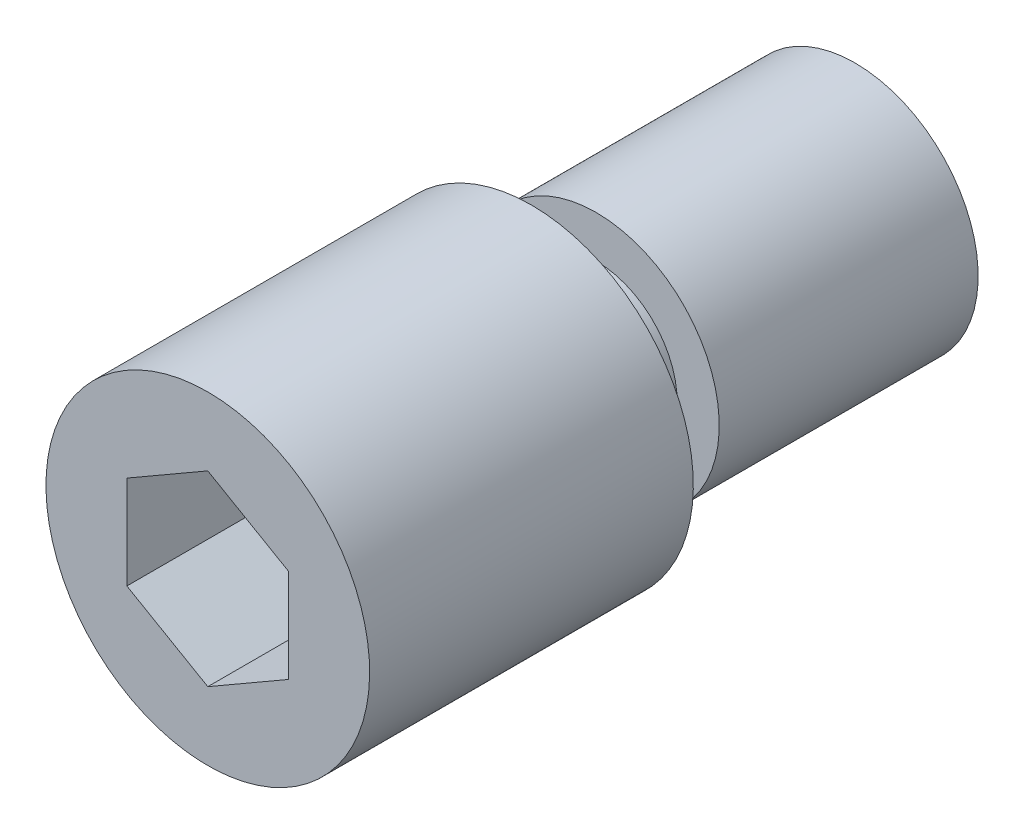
ISO-10303-21;
HEADER;
FILE_DESCRIPTION(('STEP AP214'),'2;1');
FILE_NAME('part.step','',(''),(''),'','','');
FILE_SCHEMA(('AUTOMOTIVE_DESIGN { 1 0 10303 214 1 1 1 1 }'));
ENDSEC;
DATA;
#1=APPLICATION_CONTEXT('core data for automotive mechanical design processes');
#2=APPLICATION_PROTOCOL_DEFINITION('international standard','automotive_design',2000,#1);
#3=PRODUCT_CONTEXT('',#1,'mechanical');
#4=PRODUCT('Part','Part','',(#3));
#5=PRODUCT_RELATED_PRODUCT_CATEGORY('part','',(#4));
#6=PRODUCT_DEFINITION_FORMATION('','',#4);
#7=PRODUCT_DEFINITION_CONTEXT('part definition',#1,'design');
#8=PRODUCT_DEFINITION('design','',#6,#7);
#9=PRODUCT_DEFINITION_SHAPE('','',#8);
#10=(LENGTH_UNIT() NAMED_UNIT(*) SI_UNIT(.MILLI.,.METRE.));
#11=(NAMED_UNIT(*) PLANE_ANGLE_UNIT() SI_UNIT($,.RADIAN.));
#12=(NAMED_UNIT(*) SI_UNIT($,.STERADIAN.) SOLID_ANGLE_UNIT());
#13=UNCERTAINTY_MEASURE_WITH_UNIT(LENGTH_MEASURE(1.E-05),#10,'distance_accuracy_value','');
#14=(GEOMETRIC_REPRESENTATION_CONTEXT(3) GLOBAL_UNCERTAINTY_ASSIGNED_CONTEXT((#13)) GLOBAL_UNIT_ASSIGNED_CONTEXT((#10,
#11,#12)) REPRESENTATION_CONTEXT('',''));
#15=CARTESIAN_POINT('',(0.,0.,0.));
#16=DIRECTION('',(0.,0.,1.));
#17=DIRECTION('',(1.,0.,0.));
#18=AXIS2_PLACEMENT_3D('',#15,#16,#17);
#19=CARTESIAN_POINT('',(0.,-5.,10.));
#20=DIRECTION('',(0.,0.,-1.));
#21=DIRECTION('',(0.,-1.,0.));
#22=AXIS2_PLACEMENT_3D('',#19,#20,#21);
#23=PLANE('',#22);
#24=CARTESIAN_POINT('',(0.,0.,10.));
#25=DIRECTION('',(0.,0.,1.));
#26=DIRECTION('',(0.,1.,0.));
#27=AXIS2_PLACEMENT_3D('',#24,#25,#26);
#28=CIRCLE('',#27,2.5);
#29=CARTESIAN_POINT('',(0.,2.5,10.));
#30=VERTEX_POINT('',#29);
#31=EDGE_CURVE('E115',#30,#30,#28,.T.);
#32=ORIENTED_EDGE('',*,*,#31,.T.);
#33=EDGE_LOOP('',(#32));
#34=FACE_BOUND('',#33,.T.);
#35=CARTESIAN_POINT('',(0.,0.,10.));
#36=DIRECTION('',(0.,0.,1.));
#37=DIRECTION('',(0.,1.,0.));
#38=AXIS2_PLACEMENT_3D('',#35,#36,#37);
#39=CIRCLE('',#38,5.);
#40=CARTESIAN_POINT('',(0.,5.,10.));
#41=VERTEX_POINT('',#40);
#42=EDGE_CURVE('E9',#41,#41,#39,.T.);
#43=ORIENTED_EDGE('',*,*,#42,.F.);
#44=EDGE_LOOP('',(#43));
#45=FACE_BOUND('',#44,.T.);
#46=ADVANCED_FACE('F14',(#34,#45),#23,.T.);
#47=CARTESIAN_POINT('',(0.,0.,20.));
#48=DIRECTION('',(0.,0.,1.));
#49=DIRECTION('',(0.,1.,0.));
#50=AXIS2_PLACEMENT_3D('',#47,#48,#49);
#51=CYLINDRICAL_SURFACE('',#50,5.);
#52=CARTESIAN_POINT('',(0.,0.,20.));
#53=DIRECTION('',(0.,0.,1.));
#54=DIRECTION('',(0.,1.,0.));
#55=AXIS2_PLACEMENT_3D('',#52,#53,#54);
#56=CIRCLE('',#55,5.);
#57=CARTESIAN_POINT('',(0.,5.,20.));
#58=VERTEX_POINT('',#57);
#59=EDGE_CURVE('E21',#58,#58,#56,.T.);
#60=ORIENTED_EDGE('',*,*,#59,.F.);
#61=EDGE_LOOP('',(#60));
#62=FACE_BOUND('',#61,.T.);
#63=ORIENTED_EDGE('',*,*,#42,.T.);
#64=EDGE_LOOP('',(#63));
#65=FACE_BOUND('',#64,.T.);
#66=ADVANCED_FACE('F136',(#62,#65),#51,.T.);
#67=CARTESIAN_POINT('',(0.,-5.,20.));
#68=DIRECTION('',(0.,0.,-1.));
#69=DIRECTION('',(0.,-1.,0.));
#70=AXIS2_PLACEMENT_3D('',#67,#68,#69);
#71=PLANE('',#70);
#72=DIRECTION('',(-0.866025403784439,-0.5,0.));
#73=VECTOR('',#72,1.);
#74=CARTESIAN_POINT('',(0.,2.88675134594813,20.));
#75=LINE('',#74,#73);
#76=CARTESIAN_POINT('',(0.,2.88675134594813,20.));
#77=VERTEX_POINT('',#76);
#78=CARTESIAN_POINT('',(-2.5,1.44337567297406,20.));
#79=VERTEX_POINT('',#78);
#80=EDGE_CURVE('E102',#77,#79,#75,.T.);
#81=ORIENTED_EDGE('',*,*,#80,.F.);
#82=DIRECTION('',(-0.866025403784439,0.5,0.));
#83=VECTOR('',#82,1.);
#84=CARTESIAN_POINT('',(2.5,1.44337567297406,20.));
#85=LINE('',#84,#83);
#86=CARTESIAN_POINT('',(2.5,1.44337567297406,20.));
#87=VERTEX_POINT('',#86);
#88=EDGE_CURVE('E28',#87,#77,#85,.T.);
#89=ORIENTED_EDGE('',*,*,#88,.F.);
#90=DIRECTION('',(0.,1.,0.));
#91=VECTOR('',#90,1.);
#92=CARTESIAN_POINT('',(2.5,-1.44337567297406,20.));
#93=LINE('',#92,#91);
#94=CARTESIAN_POINT('',(2.5,-1.44337567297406,20.));
#95=VERTEX_POINT('',#94);
#96=EDGE_CURVE('E111',#95,#87,#93,.T.);
#97=ORIENTED_EDGE('',*,*,#96,.F.);
#98=DIRECTION('',(0.866025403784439,0.5,0.));
#99=VECTOR('',#98,1.);
#100=CARTESIAN_POINT('',(0.,-2.88675134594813,20.));
#101=LINE('',#100,#99);
#102=CARTESIAN_POINT('',(0.,-2.88675134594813,20.));
#103=VERTEX_POINT('',#102);
#104=EDGE_CURVE('E109',#103,#95,#101,.T.);
#105=ORIENTED_EDGE('',*,*,#104,.F.);
#106=DIRECTION('',(0.866025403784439,-0.5,0.));
#107=VECTOR('',#106,1.);
#108=CARTESIAN_POINT('',(-2.5,-1.44337567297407,20.));
#109=LINE('',#108,#107);
#110=CARTESIAN_POINT('',(-2.5,-1.44337567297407,20.));
#111=VERTEX_POINT('',#110);
#112=EDGE_CURVE('E76',#111,#103,#109,.T.);
#113=ORIENTED_EDGE('',*,*,#112,.F.);
#114=DIRECTION('',(0.,-1.,0.));
#115=VECTOR('',#114,1.);
#116=CARTESIAN_POINT('',(-2.5,1.44337567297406,20.));
#117=LINE('',#116,#115);
#118=EDGE_CURVE('E105',#79,#111,#117,.T.);
#119=ORIENTED_EDGE('',*,*,#118,.F.);
#120=EDGE_LOOP('',(#81,#89,#97,#105,#113,#119));
#121=FACE_BOUND('',#120,.T.);
#122=ORIENTED_EDGE('',*,*,#59,.T.);
#123=EDGE_LOOP('',(#122));
#124=FACE_BOUND('',#123,.T.);
#125=ADVANCED_FACE('F134',(#121,#124),#71,.F.);
#126=CARTESIAN_POINT('',(0.,-3.8,0.));
#127=DIRECTION('',(0.,0.,-1.));
#128=DIRECTION('',(0.,-1.,0.));
#129=AXIS2_PLACEMENT_3D('',#126,#127,#128);
#130=PLANE('',#129);
#131=CARTESIAN_POINT('',(0.,0.,0.));
#132=DIRECTION('',(0.,0.,1.));
#133=DIRECTION('',(0.,1.,0.));
#134=AXIS2_PLACEMENT_3D('',#131,#132,#133);
#135=CIRCLE('',#134,3.8);
#136=CARTESIAN_POINT('',(0.,3.8,0.));
#137=VERTEX_POINT('',#136);
#138=EDGE_CURVE('E129',#137,#137,#135,.T.);
#139=ORIENTED_EDGE('',*,*,#138,.F.);
#140=EDGE_LOOP('',(#139));
#141=FACE_BOUND('',#140,.T.);
#142=ADVANCED_FACE('F167',(#141),#130,.T.);
#143=CARTESIAN_POINT('',(0.,0.,20.));
#144=DIRECTION('',(0.,0.,1.));
#145=DIRECTION('',(0.,1.,0.));
#146=AXIS2_PLACEMENT_3D('',#143,#144,#145);
#147=CYLINDRICAL_SURFACE('',#146,3.8);
#148=ORIENTED_EDGE('',*,*,#138,.T.);
#149=EDGE_LOOP('',(#148));
#150=FACE_BOUND('',#149,.T.);
#151=CARTESIAN_POINT('',(0.,0.,8.));
#152=DIRECTION('',(0.,0.,1.));
#153=DIRECTION('',(0.,1.,0.));
#154=AXIS2_PLACEMENT_3D('',#151,#152,#153);
#155=CIRCLE('',#154,3.8);
#156=CARTESIAN_POINT('',(0.,3.8,8.));
#157=VERTEX_POINT('',#156);
#158=EDGE_CURVE('E126',#157,#157,#155,.T.);
#159=ORIENTED_EDGE('',*,*,#158,.F.);
#160=EDGE_LOOP('',(#159));
#161=FACE_BOUND('',#160,.T.);
#162=ADVANCED_FACE('F160',(#150,#161),#147,.T.);
#163=CARTESIAN_POINT('',(0.,-2.5,8.));
#164=DIRECTION('',(0.,0.,1.));
#165=DIRECTION('',(0.,1.,0.));
#166=AXIS2_PLACEMENT_3D('',#163,#164,#165);
#167=PLANE('',#166);
#168=ORIENTED_EDGE('',*,*,#158,.T.);
#169=EDGE_LOOP('',(#168));
#170=FACE_BOUND('',#169,.T.);
#171=CARTESIAN_POINT('',(0.,0.,8.));
#172=DIRECTION('',(0.,0.,1.));
#173=DIRECTION('',(0.,1.,0.));
#174=AXIS2_PLACEMENT_3D('',#171,#172,#173);
#175=CIRCLE('',#174,2.5);
#176=CARTESIAN_POINT('',(0.,2.5,8.));
#177=VERTEX_POINT('',#176);
#178=EDGE_CURVE('E123',#177,#177,#175,.T.);
#179=ORIENTED_EDGE('',*,*,#178,.F.);
#180=EDGE_LOOP('',(#179));
#181=FACE_BOUND('',#180,.T.);
#182=ADVANCED_FACE('F151',(#170,#181),#167,.T.);
#183=CARTESIAN_POINT('',(0.,0.,20.));
#184=DIRECTION('',(0.,0.,1.));
#185=DIRECTION('',(0.,1.,0.));
#186=AXIS2_PLACEMENT_3D('',#183,#184,#185);
#187=CYLINDRICAL_SURFACE('',#186,2.5);
#188=ORIENTED_EDGE('',*,*,#178,.T.);
#189=EDGE_LOOP('',(#188));
#190=FACE_BOUND('',#189,.T.);
#191=ORIENTED_EDGE('',*,*,#31,.F.);
#192=EDGE_LOOP('',(#191));
#193=FACE_BOUND('',#192,.T.);
#194=ADVANCED_FACE('F148',(#190,#193),#187,.T.);
#195=CARTESIAN_POINT('',(2.5,1.44337567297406,14.));
#196=DIRECTION('',(0.5,0.866025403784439,0.));
#197=DIRECTION('',(-0.866025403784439,0.5,0.));
#198=AXIS2_PLACEMENT_3D('',#195,#196,#197);
#199=PLANE('',#198);
#200=ORIENTED_EDGE('',*,*,#88,.T.);
#201=DIRECTION('',(0.,0.,1.));
#202=VECTOR('',#201,1.);
#203=CARTESIAN_POINT('',(0.,2.88675134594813,14.));
#204=LINE('',#203,#202);
#205=CARTESIAN_POINT('',(0.,2.88675134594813,14.));
#206=VERTEX_POINT('',#205);
#207=EDGE_CURVE('E58',#206,#77,#204,.T.);
#208=ORIENTED_EDGE('',*,*,#207,.F.);
#209=DIRECTION('',(-0.866025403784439,0.5,0.));
#210=VECTOR('',#209,1.);
#211=CARTESIAN_POINT('',(2.5,1.44337567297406,14.));
#212=LINE('',#211,#210);
#213=CARTESIAN_POINT('',(2.5,1.44337567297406,14.));
#214=VERTEX_POINT('',#213);
#215=EDGE_CURVE('E113',#214,#206,#212,.T.);
#216=ORIENTED_EDGE('',*,*,#215,.F.);
#217=DIRECTION('',(0.,0.,1.));
#218=VECTOR('',#217,1.);
#219=CARTESIAN_POINT('',(2.5,1.44337567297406,14.));
#220=LINE('',#219,#218);
#221=EDGE_CURVE('E36',#214,#87,#220,.T.);
#222=ORIENTED_EDGE('',*,*,#221,.T.);
#223=EDGE_LOOP('',(#200,#208,#216,#222));
#224=FACE_BOUND('',#223,.T.);
#225=ADVANCED_FACE('F150',(#224),#199,.F.);
#226=CARTESIAN_POINT('',(2.5,-1.44337567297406,14.));
#227=DIRECTION('',(1.,0.,0.));
#228=DIRECTION('',(0.,1.,0.));
#229=AXIS2_PLACEMENT_3D('',#226,#227,#228);
#230=PLANE('',#229);
#231=ORIENTED_EDGE('',*,*,#96,.T.);
#232=ORIENTED_EDGE('',*,*,#221,.F.);
#233=DIRECTION('',(0.,1.,0.));
#234=VECTOR('',#233,1.);
#235=CARTESIAN_POINT('',(2.5,-1.44337567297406,14.));
#236=LINE('',#235,#234);
#237=CARTESIAN_POINT('',(2.5,-1.44337567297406,14.));
#238=VERTEX_POINT('',#237);
#239=EDGE_CURVE('E88',#238,#214,#236,.T.);
#240=ORIENTED_EDGE('',*,*,#239,.F.);
#241=DIRECTION('',(0.,0.,1.));
#242=VECTOR('',#241,1.);
#243=CARTESIAN_POINT('',(2.5,-1.44337567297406,14.));
#244=LINE('',#243,#242);
#245=EDGE_CURVE('E80',#238,#95,#244,.T.);
#246=ORIENTED_EDGE('',*,*,#245,.T.);
#247=EDGE_LOOP('',(#231,#232,#240,#246));
#248=FACE_BOUND('',#247,.T.);
#249=ADVANCED_FACE('F158',(#248),#230,.F.);
#250=CARTESIAN_POINT('',(0.,-2.88675134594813,14.));
#251=DIRECTION('',(0.5,-0.866025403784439,0.));
#252=DIRECTION('',(0.866025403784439,0.5,0.));
#253=AXIS2_PLACEMENT_3D('',#250,#251,#252);
#254=PLANE('',#253);
#255=ORIENTED_EDGE('',*,*,#104,.T.);
#256=ORIENTED_EDGE('',*,*,#245,.F.);
#257=DIRECTION('',(0.866025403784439,0.5,0.));
#258=VECTOR('',#257,1.);
#259=CARTESIAN_POINT('',(0.,-2.88675134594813,14.));
#260=LINE('',#259,#258);
#261=CARTESIAN_POINT('',(0.,-2.88675134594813,14.));
#262=VERTEX_POINT('',#261);
#263=EDGE_CURVE('E84',#262,#238,#260,.T.);
#264=ORIENTED_EDGE('',*,*,#263,.F.);
#265=DIRECTION('',(0.,0.,1.));
#266=VECTOR('',#265,1.);
#267=CARTESIAN_POINT('',(0.,-2.88675134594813,14.));
#268=LINE('',#267,#266);
#269=EDGE_CURVE('E69',#262,#103,#268,.T.);
#270=ORIENTED_EDGE('',*,*,#269,.T.);
#271=EDGE_LOOP('',(#255,#256,#264,#270));
#272=FACE_BOUND('',#271,.T.);
#273=ADVANCED_FACE('F85',(#272),#254,.F.);
#274=CARTESIAN_POINT('',(-2.5,-1.44337567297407,14.));
#275=DIRECTION('',(-0.5,-0.866025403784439,0.));
#276=DIRECTION('',(0.866025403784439,-0.5,0.));
#277=AXIS2_PLACEMENT_3D('',#274,#275,#276);
#278=PLANE('',#277);
#279=ORIENTED_EDGE('',*,*,#112,.T.);
#280=ORIENTED_EDGE('',*,*,#269,.F.);
#281=DIRECTION('',(0.866025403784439,-0.5,0.));
#282=VECTOR('',#281,1.);
#283=CARTESIAN_POINT('',(-2.5,-1.44337567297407,14.));
#284=LINE('',#283,#282);
#285=CARTESIAN_POINT('',(-2.5,-1.44337567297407,14.));
#286=VERTEX_POINT('',#285);
#287=EDGE_CURVE('E73',#286,#262,#284,.T.);
#288=ORIENTED_EDGE('',*,*,#287,.F.);
#289=DIRECTION('',(0.,0.,1.));
#290=VECTOR('',#289,1.);
#291=CARTESIAN_POINT('',(-2.5,-1.44337567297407,14.));
#292=LINE('',#291,#290);
#293=EDGE_CURVE('E81',#286,#111,#292,.T.);
#294=ORIENTED_EDGE('',*,*,#293,.T.);
#295=EDGE_LOOP('',(#279,#280,#288,#294));
#296=FACE_BOUND('',#295,.T.);
#297=ADVANCED_FACE('F71',(#296),#278,.F.);
#298=CARTESIAN_POINT('',(-2.5,1.44337567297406,14.));
#299=DIRECTION('',(-1.,0.,0.));
#300=DIRECTION('',(0.,-1.,0.));
#301=AXIS2_PLACEMENT_3D('',#298,#299,#300);
#302=PLANE('',#301);
#303=ORIENTED_EDGE('',*,*,#118,.T.);
#304=ORIENTED_EDGE('',*,*,#293,.F.);
#305=DIRECTION('',(0.,-1.,0.));
#306=VECTOR('',#305,1.);
#307=CARTESIAN_POINT('',(-2.5,1.44337567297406,14.));
#308=LINE('',#307,#306);
#309=CARTESIAN_POINT('',(-2.5,1.44337567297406,14.));
#310=VERTEX_POINT('',#309);
#311=EDGE_CURVE('E94',#310,#286,#308,.T.);
#312=ORIENTED_EDGE('',*,*,#311,.F.);
#313=DIRECTION('',(0.,0.,1.));
#314=VECTOR('',#313,1.);
#315=CARTESIAN_POINT('',(-2.5,1.44337567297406,14.));
#316=LINE('',#315,#314);
#317=EDGE_CURVE('E118',#310,#79,#316,.T.);
#318=ORIENTED_EDGE('',*,*,#317,.T.);
#319=EDGE_LOOP('',(#303,#304,#312,#318));
#320=FACE_BOUND('',#319,.T.);
#321=ADVANCED_FACE('F192',(#320),#302,.F.);
#322=CARTESIAN_POINT('',(0.,2.88675134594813,14.));
#323=DIRECTION('',(-0.5,0.866025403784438,0.));
#324=DIRECTION('',(-0.866025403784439,-0.5,0.));
#325=AXIS2_PLACEMENT_3D('',#322,#323,#324);
#326=PLANE('',#325);
#327=ORIENTED_EDGE('',*,*,#80,.T.);
#328=ORIENTED_EDGE('',*,*,#317,.F.);
#329=DIRECTION('',(-0.866025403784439,-0.5,0.));
#330=VECTOR('',#329,1.);
#331=CARTESIAN_POINT('',(0.,2.88675134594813,14.));
#332=LINE('',#331,#330);
#333=EDGE_CURVE('E96',#206,#310,#332,.T.);
#334=ORIENTED_EDGE('',*,*,#333,.F.);
#335=ORIENTED_EDGE('',*,*,#207,.T.);
#336=EDGE_LOOP('',(#327,#328,#334,#335));
#337=FACE_BOUND('',#336,.T.);
#338=ADVANCED_FACE('F180',(#337),#326,.F.);
#339=CARTESIAN_POINT('',(0.,2.88675134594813,14.));
#340=DIRECTION('',(0.,0.,1.));
#341=DIRECTION('',(1.,0.,0.));
#342=AXIS2_PLACEMENT_3D('',#339,#340,#341);
#343=PLANE('',#342);
#344=ORIENTED_EDGE('',*,*,#215,.T.);
#345=ORIENTED_EDGE('',*,*,#333,.T.);
#346=ORIENTED_EDGE('',*,*,#311,.T.);
#347=ORIENTED_EDGE('',*,*,#287,.T.);
#348=ORIENTED_EDGE('',*,*,#263,.T.);
#349=ORIENTED_EDGE('',*,*,#239,.T.);
#350=EDGE_LOOP('',(#344,#345,#346,#347,#348,#349));
#351=FACE_BOUND('',#350,.T.);
#352=ADVANCED_FACE('F91',(#351),#343,.T.);
#353=CLOSED_SHELL('',(#46,#66,#125,#142,#162,#182,#194,#225,#249,#273,#297,#321,#338,#352));
#354=MANIFOLD_SOLID_BREP('B1',#353);
#355=ADVANCED_BREP_SHAPE_REPRESENTATION('',(#18,#354),#14);
#356=SHAPE_DEFINITION_REPRESENTATION(#9,#355);
ENDSEC;
END-ISO-10303-21;
